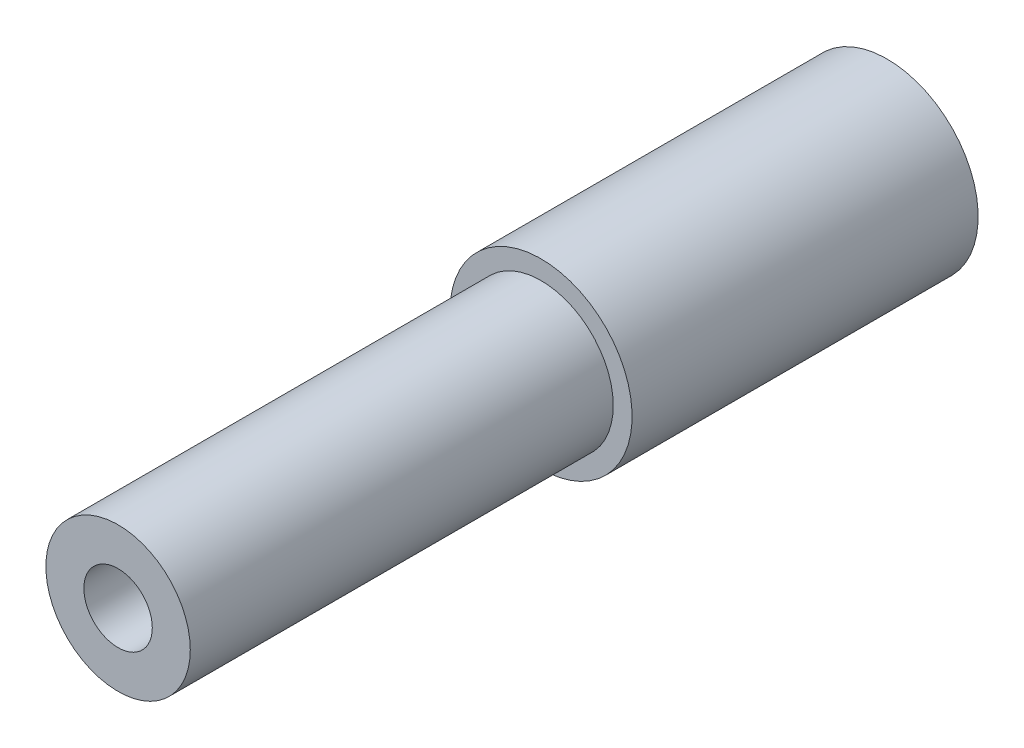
from build123d import *

# Parameters (mm, degrees)
SKETCH1_R                 = 2.38506
EXTRUDE1_DEPTH            = 25.4
SKETCH2_R                 = 3.00736
EXTRUDE2_DEPTH            = 11.43
F_4_40_TAPPED_HOLE1_D     = 2.2606
F_4_40_TAPPED_HOLE1_DEPTH = 8.8646
F_4_40_TAPPED_HOLE1_TIP   = 0.679152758


with BuildPart() as part:
    # Sketch1 → Extrude1 (new body)
    with BuildSketch(Plane.XY):
        Circle(SKETCH1_R)
    extrude(amount=-EXTRUDE1_DEPTH)

    # Sketch2 → Extrude2 (add)
    with BuildSketch(Plane(origin=(0, 0, -25.4), x_dir=(-1, 0, 0), z_dir=(0, 0, -1))):
        Circle(SKETCH2_R)
    extrude(amount=-EXTRUDE2_DEPTH)

    # 4-40 Tapped Hole1
    with Locations(Plane.XY):
        with Locations((0, 0)):
            Hole(F_4_40_TAPPED_HOLE1_D / 2, depth=F_4_40_TAPPED_HOLE1_DEPTH)
            with Locations((0, 0, -(F_4_40_TAPPED_HOLE1_DEPTH + F_4_40_TAPPED_HOLE1_TIP / 2))):  # 118° drill point
                Cone(0, F_4_40_TAPPED_HOLE1_D / 2, F_4_40_TAPPED_HOLE1_TIP, mode=Mode.SUBTRACT)


solid = part.part
